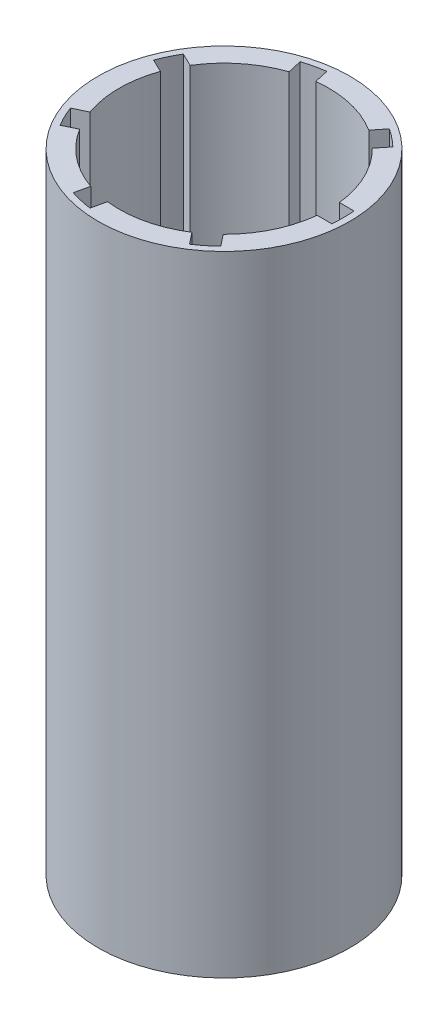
ISO-10303-21;
HEADER;
FILE_DESCRIPTION(('STEP AP214'),'2;1');
FILE_NAME('part.step','',(''),(''),'','','');
FILE_SCHEMA(('AUTOMOTIVE_DESIGN { 1 0 10303 214 1 1 1 1 }'));
ENDSEC;
DATA;
#1=APPLICATION_CONTEXT('core data for automotive mechanical design processes');
#2=APPLICATION_PROTOCOL_DEFINITION('international standard','automotive_design',2000,#1);
#3=PRODUCT_CONTEXT('',#1,'mechanical');
#4=PRODUCT('Part','Part','',(#3));
#5=PRODUCT_RELATED_PRODUCT_CATEGORY('part','',(#4));
#6=PRODUCT_DEFINITION_FORMATION('','',#4);
#7=PRODUCT_DEFINITION_CONTEXT('part definition',#1,'design');
#8=PRODUCT_DEFINITION('design','',#6,#7);
#9=PRODUCT_DEFINITION_SHAPE('','',#8);
#10=(LENGTH_UNIT() NAMED_UNIT(*) SI_UNIT(.MILLI.,.METRE.));
#11=(NAMED_UNIT(*) PLANE_ANGLE_UNIT() SI_UNIT($,.RADIAN.));
#12=(NAMED_UNIT(*) SI_UNIT($,.STERADIAN.) SOLID_ANGLE_UNIT());
#13=UNCERTAINTY_MEASURE_WITH_UNIT(LENGTH_MEASURE(1.E-05),#10,'distance_accuracy_value','');
#14=(GEOMETRIC_REPRESENTATION_CONTEXT(3) GLOBAL_UNCERTAINTY_ASSIGNED_CONTEXT((#13)) GLOBAL_UNIT_ASSIGNED_CONTEXT((#10,
#11,#12)) REPRESENTATION_CONTEXT('',''));
#15=CARTESIAN_POINT('',(0.,0.,0.));
#16=DIRECTION('',(0.,0.,1.));
#17=DIRECTION('',(1.,0.,0.));
#18=AXIS2_PLACEMENT_3D('',#15,#16,#17);
#19=CARTESIAN_POINT('',(0.,195.,0.));
#20=DIRECTION('',(0.,1.,0.));
#21=DIRECTION('',(0.,0.,1.));
#22=AXIS2_PLACEMENT_3D('',#19,#20,#21);
#23=PLANE('',#22);
#24=CARTESIAN_POINT('',(0.,195.,0.));
#25=DIRECTION('',(0.,1.,0.));
#26=DIRECTION('',(0.,0.,1.));
#27=AXIS2_PLACEMENT_3D('',#24,#25,#26);
#28=CIRCLE('',#27,39.);
#29=CARTESIAN_POINT('',(0.,195.,39.));
#30=VERTEX_POINT('',#29);
#31=EDGE_CURVE('E11',#30,#30,#28,.T.);
#32=ORIENTED_EDGE('',*,*,#31,.T.);
#33=EDGE_LOOP('',(#32));
#34=FACE_BOUND('',#33,.T.);
#35=DIRECTION('',(-0.900968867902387,0.,-0.433883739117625));
#36=VECTOR('',#35,1.);
#37=CARTESIAN_POINT('',(-31.7056204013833,195.,-19.0984451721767));
#38=LINE('',#37,#36);
#39=CARTESIAN_POINT('',(-27.6188483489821,195.,-17.130359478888));
#40=VERTEX_POINT('',#39);
#41=CARTESIAN_POINT('',(-31.7056204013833,195.,-19.0984451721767));
#42=VERTEX_POINT('',#41);
#43=EDGE_CURVE('E223',#40,#42,#38,.T.);
#44=ORIENTED_EDGE('',*,*,#43,.F.);
#45=CARTESIAN_POINT('',(0.,195.,0.));
#46=DIRECTION('',(0.,1.,0.));
#47=DIRECTION('',(0.,0.,1.));
#48=AXIS2_PLACEMENT_3D('',#45,#46,#47);
#49=CIRCLE('',#48,32.5);
#50=CARTESIAN_POINT('',(-10.5550936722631,195.,-30.7382497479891));
#51=VERTEX_POINT('',#50);
#52=EDGE_CURVE('E215',#51,#40,#49,.T.);
#53=ORIENTED_EDGE('',*,*,#52,.F.);
#54=DIRECTION('',(0.222520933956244,0.,0.97492791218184));
#55=VECTOR('',#54,1.);
#56=CARTESIAN_POINT('',(-11.5644430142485,195.,-35.1604981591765));
#57=LINE('',#56,#55);
#58=CARTESIAN_POINT('',(-11.5644430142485,195.,-35.1604981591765));
#59=VERTEX_POINT('',#58);
#60=EDGE_CURVE('E287',#59,#51,#57,.T.);
#61=ORIENTED_EDGE('',*,*,#60,.F.);
#62=CARTESIAN_POINT('',(0.,195.,0.));
#63=DIRECTION('',(0.,1.,0.));
#64=DIRECTION('',(0.,0.,-1.));
#65=AXIS2_PLACEMENT_3D('',#62,#63,#64);
#66=CIRCLE('',#65,37.0134701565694);
#67=CARTESIAN_POINT('',(-4.8363652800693,195.,-36.6961379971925));
#68=VERTEX_POINT('',#67);
#69=EDGE_CURVE('E285',#68,#59,#66,.T.);
#70=ORIENTED_EDGE('',*,*,#69,.F.);
#71=DIRECTION('',(-0.222520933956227,0.,-0.974927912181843));
#72=VECTOR('',#71,1.);
#73=CARTESIAN_POINT('',(-4.8363652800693,195.,-36.6961379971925));
#74=LINE('',#73,#72);
#75=CARTESIAN_POINT('',(-3.82701593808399,195.,-32.2738895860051));
#76=VERTEX_POINT('',#75);
#77=EDGE_CURVE('E283',#76,#68,#74,.T.);
#78=ORIENTED_EDGE('',*,*,#77,.F.);
#79=CARTESIAN_POINT('',(0.,195.,0.));
#80=DIRECTION('',(0.,1.,0.));
#81=DIRECTION('',(0.,0.,1.));
#82=AXIS2_PLACEMENT_3D('',#79,#80,#81);
#83=CIRCLE('',#82,32.5);
#84=CARTESIAN_POINT('',(17.4511381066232,195.,-27.4172897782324));
#85=VERTEX_POINT('',#84);
#86=EDGE_CURVE('E281',#85,#76,#83,.T.);
#87=ORIENTED_EDGE('',*,*,#86,.F.);
#88=DIRECTION('',(-0.623489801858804,0.,0.781831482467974));
#89=VECTOR('',#88,1.);
#90=CARTESIAN_POINT('',(20.2792721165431,195.,-30.9636576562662));
#91=LINE('',#90,#89);
#92=CARTESIAN_POINT('',(20.279272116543,195.,-30.9636576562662));
#93=VERTEX_POINT('',#92);
#94=EDGE_CURVE('E279',#93,#85,#91,.T.);
#95=ORIENTED_EDGE('',*,*,#94,.F.);
#96=CARTESIAN_POINT('',(0.,195.,0.));
#97=DIRECTION('',(0.,1.,0.));
#98=DIRECTION('',(0.,0.,-1.));
#99=AXIS2_PLACEMENT_3D('',#96,#97,#98);
#100=CIRCLE('',#99,37.0134701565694);
#101=CARTESIAN_POINT('',(25.6747715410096,195.,-26.6608904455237));
#102=VERTEX_POINT('',#101);
#103=EDGE_CURVE('E277',#102,#93,#100,.T.);
#104=ORIENTED_EDGE('',*,*,#103,.F.);
#105=DIRECTION('',(0.623489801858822,0.,-0.78183148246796));
#106=VECTOR('',#105,1.);
#107=CARTESIAN_POINT('',(25.6747715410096,195.,-26.6608904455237));
#108=LINE('',#107,#106);
#109=CARTESIAN_POINT('',(22.8466375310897,195.,-23.11452256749));
#110=VERTEX_POINT('',#109);
#111=EDGE_CURVE('E275',#110,#102,#108,.T.);
#112=ORIENTED_EDGE('',*,*,#111,.F.);
#113=CARTESIAN_POINT('',(0.,195.,0.));
#114=DIRECTION('',(0.,1.,0.));
#115=DIRECTION('',(0.,0.,1.));
#116=AXIS2_PLACEMENT_3D('',#113,#114,#115);
#117=CIRCLE('',#116,32.5);
#118=CARTESIAN_POINT('',(32.3163069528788,195.,-3.45055139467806));
#119=VERTEX_POINT('',#118);
#120=EDGE_CURVE('E273',#119,#110,#117,.T.);
#121=ORIENTED_EDGE('',*,*,#120,.F.);
#122=DIRECTION('',(-1.,0.,0.));
#123=VECTOR('',#122,1.);
#124=CARTESIAN_POINT('',(36.8522817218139,195.,-3.45055139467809));
#125=LINE('',#124,#123);
#126=CARTESIAN_POINT('',(36.8522817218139,195.,-3.45055139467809));
#127=VERTEX_POINT('',#126);
#128=EDGE_CURVE('E271',#127,#119,#125,.T.);
#129=ORIENTED_EDGE('',*,*,#128,.F.);
#130=CARTESIAN_POINT('',(0.,195.,0.));
#131=DIRECTION('',(0.,1.,0.));
#132=DIRECTION('',(0.,0.,-1.));
#133=AXIS2_PLACEMENT_3D('',#130,#131,#132);
#134=CIRCLE('',#133,37.0134701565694);
#135=CARTESIAN_POINT('',(36.8522817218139,195.,3.45055139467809));
#136=VERTEX_POINT('',#135);
#137=EDGE_CURVE('E269',#136,#127,#134,.T.);
#138=ORIENTED_EDGE('',*,*,#137,.F.);
#139=DIRECTION('',(1.,0.,0.));
#140=VECTOR('',#139,1.);
#141=CARTESIAN_POINT('',(36.8522817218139,195.,3.45055139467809));
#142=LINE('',#141,#140);
#143=CARTESIAN_POINT('',(32.3163069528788,195.,3.45055139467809));
#144=VERTEX_POINT('',#143);
#145=EDGE_CURVE('E267',#144,#136,#142,.T.);
#146=ORIENTED_EDGE('',*,*,#145,.F.);
#147=CARTESIAN_POINT('',(0.,195.,0.));
#148=DIRECTION('',(0.,1.,0.));
#149=DIRECTION('',(0.,0.,1.));
#150=AXIS2_PLACEMENT_3D('',#147,#148,#149);
#151=CIRCLE('',#150,32.5);
#152=CARTESIAN_POINT('',(22.8466375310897,195.,23.11452256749));
#153=VERTEX_POINT('',#152);
#154=EDGE_CURVE('E265',#153,#144,#151,.T.);
#155=ORIENTED_EDGE('',*,*,#154,.F.);
#156=DIRECTION('',(-0.623489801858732,0.,-0.781831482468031));
#157=VECTOR('',#156,1.);
#158=CARTESIAN_POINT('',(25.6747715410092,195.,26.6608904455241));
#159=LINE('',#158,#157);
#160=CARTESIAN_POINT('',(25.6747715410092,195.,26.6608904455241));
#161=VERTEX_POINT('',#160);
#162=EDGE_CURVE('E263',#161,#153,#159,.T.);
#163=ORIENTED_EDGE('',*,*,#162,.F.);
#164=CARTESIAN_POINT('',(0.,195.,0.));
#165=DIRECTION('',(0.,1.,0.));
#166=DIRECTION('',(0.,0.,-1.));
#167=AXIS2_PLACEMENT_3D('',#164,#165,#166);
#168=CIRCLE('',#167,37.0134701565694);
#169=CARTESIAN_POINT('',(20.2792721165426,195.,30.9636576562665));
#170=VERTEX_POINT('',#169);
#171=EDGE_CURVE('E261',#170,#161,#168,.T.);
#172=ORIENTED_EDGE('',*,*,#171,.F.);
#173=DIRECTION('',(0.623489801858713,0.,0.781831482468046));
#174=VECTOR('',#173,1.);
#175=CARTESIAN_POINT('',(20.2792721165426,195.,30.9636576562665));
#176=LINE('',#175,#174);
#177=CARTESIAN_POINT('',(17.4511381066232,195.,27.4172897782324));
#178=VERTEX_POINT('',#177);
#179=EDGE_CURVE('E259',#178,#170,#176,.T.);
#180=ORIENTED_EDGE('',*,*,#179,.F.);
#181=CARTESIAN_POINT('',(0.,195.,0.));
#182=DIRECTION('',(0.,1.,0.));
#183=DIRECTION('',(0.,0.,1.));
#184=AXIS2_PLACEMENT_3D('',#181,#182,#183);
#185=CIRCLE('',#184,32.5);
#186=CARTESIAN_POINT('',(-3.82701593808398,195.,32.2738895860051));
#187=VERTEX_POINT('',#186);
#188=EDGE_CURVE('E257',#187,#178,#185,.T.);
#189=ORIENTED_EDGE('',*,*,#188,.F.);
#190=DIRECTION('',(0.222520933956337,0.,-0.974927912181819));
#191=VECTOR('',#190,1.);
#192=CARTESIAN_POINT('',(-4.8363652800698,195.,36.6961379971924));
#193=LINE('',#192,#191);
#194=CARTESIAN_POINT('',(-4.83636528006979,195.,36.6961379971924));
#195=VERTEX_POINT('',#194);
#196=EDGE_CURVE('E255',#195,#187,#193,.T.);
#197=ORIENTED_EDGE('',*,*,#196,.F.);
#198=CARTESIAN_POINT('',(0.,195.,0.));
#199=DIRECTION('',(0.,1.,0.));
#200=DIRECTION('',(0.,0.,-1.));
#201=AXIS2_PLACEMENT_3D('',#198,#199,#200);
#202=CIRCLE('',#201,37.0134701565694);
#203=CARTESIAN_POINT('',(-11.564443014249,195.,35.1604981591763));
#204=VERTEX_POINT('',#203);
#205=EDGE_CURVE('E253',#204,#195,#202,.T.);
#206=ORIENTED_EDGE('',*,*,#205,.F.);
#207=DIRECTION('',(-0.222520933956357,0.,0.974927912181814));
#208=VECTOR('',#207,1.);
#209=CARTESIAN_POINT('',(-11.564443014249,195.,35.1604981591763));
#210=LINE('',#209,#208);
#211=CARTESIAN_POINT('',(-10.5550936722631,195.,30.7382497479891));
#212=VERTEX_POINT('',#211);
#213=EDGE_CURVE('E251',#212,#204,#210,.T.);
#214=ORIENTED_EDGE('',*,*,#213,.F.);
#215=CARTESIAN_POINT('',(0.,195.,0.));
#216=DIRECTION('',(0.,1.,0.));
#217=DIRECTION('',(0.,0.,1.));
#218=AXIS2_PLACEMENT_3D('',#215,#216,#217);
#219=CIRCLE('',#218,32.5);
#220=CARTESIAN_POINT('',(-27.6188483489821,195.,17.130359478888));
#221=VERTEX_POINT('',#220);
#222=EDGE_CURVE('E249',#221,#212,#219,.T.);
#223=ORIENTED_EDGE('',*,*,#222,.F.);
#224=DIRECTION('',(0.900968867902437,0.,-0.433883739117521));
#225=VECTOR('',#224,1.);
#226=CARTESIAN_POINT('',(-31.7056204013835,195.,19.0984451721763));
#227=LINE('',#226,#225);
#228=CARTESIAN_POINT('',(-31.7056204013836,195.,19.0984451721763));
#229=VERTEX_POINT('',#228);
#230=EDGE_CURVE('E247',#229,#221,#227,.T.);
#231=ORIENTED_EDGE('',*,*,#230,.F.);
#232=CARTESIAN_POINT('',(0.,195.,0.));
#233=DIRECTION('',(0.,1.,0.));
#234=DIRECTION('',(0.,0.,-1.));
#235=AXIS2_PLACEMENT_3D('',#232,#233,#234);
#236=CIRCLE('',#235,37.0134701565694);
#237=CARTESIAN_POINT('',(-34.6998966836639,195.,12.8807664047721));
#238=VERTEX_POINT('',#237);
#239=EDGE_CURVE('E245',#238,#229,#236,.T.);
#240=ORIENTED_EDGE('',*,*,#239,.F.);
#241=DIRECTION('',(-0.900968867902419,0.,0.433883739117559));
#242=VECTOR('',#241,1.);
#243=CARTESIAN_POINT('',(-34.6998966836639,195.,12.8807664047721));
#244=LINE('',#243,#242);
#245=CARTESIAN_POINT('',(-30.6131246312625,195.,10.9126807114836));
#246=VERTEX_POINT('',#245);
#247=EDGE_CURVE('E243',#246,#238,#244,.T.);
#248=ORIENTED_EDGE('',*,*,#247,.F.);
#249=CARTESIAN_POINT('',(0.,195.,0.));
#250=DIRECTION('',(0.,1.,0.));
#251=DIRECTION('',(0.,0.,1.));
#252=AXIS2_PLACEMENT_3D('',#249,#250,#251);
#253=CIRCLE('',#252,32.5);
#254=CARTESIAN_POINT('',(-30.6131246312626,195.,-10.9126807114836));
#255=VERTEX_POINT('',#254);
#256=EDGE_CURVE('E241',#255,#246,#253,.T.);
#257=ORIENTED_EDGE('',*,*,#256,.F.);
#258=DIRECTION('',(0.900968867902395,0.,0.433883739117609));
#259=VECTOR('',#258,1.);
#260=CARTESIAN_POINT('',(-34.6998966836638,195.,-12.8807664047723));
#261=LINE('',#260,#259);
#262=CARTESIAN_POINT('',(-34.6998966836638,195.,-12.8807664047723));
#263=VERTEX_POINT('',#262);
#264=EDGE_CURVE('E237',#263,#255,#261,.T.);
#265=ORIENTED_EDGE('',*,*,#264,.F.);
#266=CARTESIAN_POINT('',(0.,195.,0.));
#267=DIRECTION('',(0.,1.,0.));
#268=DIRECTION('',(0.,0.,-1.));
#269=AXIS2_PLACEMENT_3D('',#266,#267,#268);
#270=CIRCLE('',#269,37.0134701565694);
#271=EDGE_CURVE('E235',#42,#263,#270,.T.);
#272=ORIENTED_EDGE('',*,*,#271,.F.);
#273=EDGE_LOOP('',(#44,#53,#61,#70,#78,#87,#95,#104,#112,#121,#129,#138,#146,#155,#163,#172,
#180,#189,#197,#206,#214,#223,#231,#240,#248,#257,#265,#272));
#274=FACE_BOUND('',#273,.T.);
#275=ADVANCED_FACE('F30',(#34,#274),#23,.T.);
#276=CARTESIAN_POINT('',(0.,0.,0.));
#277=DIRECTION('',(0.,1.,0.));
#278=DIRECTION('',(0.,0.,1.));
#279=AXIS2_PLACEMENT_3D('',#276,#277,#278);
#280=PLANE('',#279);
#281=CARTESIAN_POINT('',(0.,0.,0.));
#282=DIRECTION('',(0.,1.,0.));
#283=DIRECTION('',(0.,0.,1.));
#284=AXIS2_PLACEMENT_3D('',#281,#282,#283);
#285=CIRCLE('',#284,39.);
#286=CARTESIAN_POINT('',(0.,0.,39.));
#287=VERTEX_POINT('',#286);
#288=EDGE_CURVE('E34',#287,#287,#285,.T.);
#289=ORIENTED_EDGE('',*,*,#288,.F.);
#290=EDGE_LOOP('',(#289));
#291=FACE_BOUND('',#290,.T.);
#292=CARTESIAN_POINT('',(0.,0.,0.));
#293=DIRECTION('',(0.,1.,0.));
#294=DIRECTION('',(0.,0.,1.));
#295=AXIS2_PLACEMENT_3D('',#292,#293,#294);
#296=CIRCLE('',#295,32.5);
#297=CARTESIAN_POINT('',(-10.5550936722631,0.,-30.7382497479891));
#298=VERTEX_POINT('',#297);
#299=CARTESIAN_POINT('',(-27.6188483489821,0.,-17.130359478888));
#300=VERTEX_POINT('',#299);
#301=EDGE_CURVE('E53',#298,#300,#296,.T.);
#302=ORIENTED_EDGE('',*,*,#301,.T.);
#303=DIRECTION('',(-0.900968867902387,0.,-0.433883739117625));
#304=VECTOR('',#303,1.);
#305=CARTESIAN_POINT('',(-31.7056204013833,0.,-19.0984451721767));
#306=LINE('',#305,#304);
#307=CARTESIAN_POINT('',(-31.7056204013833,0.,-19.0984451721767));
#308=VERTEX_POINT('',#307);
#309=EDGE_CURVE('E230',#300,#308,#306,.T.);
#310=ORIENTED_EDGE('',*,*,#309,.T.);
#311=CARTESIAN_POINT('',(0.,0.,0.));
#312=DIRECTION('',(0.,1.,0.));
#313=DIRECTION('',(0.,0.,-1.));
#314=AXIS2_PLACEMENT_3D('',#311,#312,#313);
#315=CIRCLE('',#314,37.0134701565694);
#316=CARTESIAN_POINT('',(-34.6998966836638,0.,-12.8807664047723));
#317=VERTEX_POINT('',#316);
#318=EDGE_CURVE('E291',#308,#317,#315,.T.);
#319=ORIENTED_EDGE('',*,*,#318,.T.);
#320=DIRECTION('',(0.900968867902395,0.,0.433883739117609));
#321=VECTOR('',#320,1.);
#322=CARTESIAN_POINT('',(-34.6998966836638,0.,-12.8807664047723));
#323=LINE('',#322,#321);
#324=CARTESIAN_POINT('',(-30.6131246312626,0.,-10.9126807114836));
#325=VERTEX_POINT('',#324);
#326=EDGE_CURVE('E294',#317,#325,#323,.T.);
#327=ORIENTED_EDGE('',*,*,#326,.T.);
#328=CARTESIAN_POINT('',(0.,0.,0.));
#329=DIRECTION('',(0.,1.,0.));
#330=DIRECTION('',(0.,0.,1.));
#331=AXIS2_PLACEMENT_3D('',#328,#329,#330);
#332=CIRCLE('',#331,32.5);
#333=CARTESIAN_POINT('',(-30.6131246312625,0.,10.9126807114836));
#334=VERTEX_POINT('',#333);
#335=EDGE_CURVE('E297',#325,#334,#332,.T.);
#336=ORIENTED_EDGE('',*,*,#335,.T.);
#337=DIRECTION('',(-0.900968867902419,0.,0.433883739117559));
#338=VECTOR('',#337,1.);
#339=CARTESIAN_POINT('',(-34.6998966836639,0.,12.8807664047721));
#340=LINE('',#339,#338);
#341=CARTESIAN_POINT('',(-34.6998966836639,0.,12.8807664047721));
#342=VERTEX_POINT('',#341);
#343=EDGE_CURVE('E300',#334,#342,#340,.T.);
#344=ORIENTED_EDGE('',*,*,#343,.T.);
#345=CARTESIAN_POINT('',(0.,0.,0.));
#346=DIRECTION('',(0.,1.,0.));
#347=DIRECTION('',(0.,0.,-1.));
#348=AXIS2_PLACEMENT_3D('',#345,#346,#347);
#349=CIRCLE('',#348,37.0134701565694);
#350=CARTESIAN_POINT('',(-31.7056204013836,0.,19.0984451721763));
#351=VERTEX_POINT('',#350);
#352=EDGE_CURVE('E303',#342,#351,#349,.T.);
#353=ORIENTED_EDGE('',*,*,#352,.T.);
#354=DIRECTION('',(0.900968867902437,0.,-0.433883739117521));
#355=VECTOR('',#354,1.);
#356=CARTESIAN_POINT('',(-31.7056204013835,0.,19.0984451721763));
#357=LINE('',#356,#355);
#358=CARTESIAN_POINT('',(-27.6188483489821,0.,17.130359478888));
#359=VERTEX_POINT('',#358);
#360=EDGE_CURVE('E306',#351,#359,#357,.T.);
#361=ORIENTED_EDGE('',*,*,#360,.T.);
#362=CARTESIAN_POINT('',(0.,0.,0.));
#363=DIRECTION('',(0.,1.,0.));
#364=DIRECTION('',(0.,0.,1.));
#365=AXIS2_PLACEMENT_3D('',#362,#363,#364);
#366=CIRCLE('',#365,32.5);
#367=CARTESIAN_POINT('',(-10.5550936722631,0.,30.7382497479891));
#368=VERTEX_POINT('',#367);
#369=EDGE_CURVE('E309',#359,#368,#366,.T.);
#370=ORIENTED_EDGE('',*,*,#369,.T.);
#371=DIRECTION('',(-0.222520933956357,0.,0.974927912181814));
#372=VECTOR('',#371,1.);
#373=CARTESIAN_POINT('',(-11.564443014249,0.,35.1604981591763));
#374=LINE('',#373,#372);
#375=CARTESIAN_POINT('',(-11.564443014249,0.,35.1604981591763));
#376=VERTEX_POINT('',#375);
#377=EDGE_CURVE('E312',#368,#376,#374,.T.);
#378=ORIENTED_EDGE('',*,*,#377,.T.);
#379=CARTESIAN_POINT('',(0.,0.,0.));
#380=DIRECTION('',(0.,1.,0.));
#381=DIRECTION('',(0.,0.,-1.));
#382=AXIS2_PLACEMENT_3D('',#379,#380,#381);
#383=CIRCLE('',#382,37.0134701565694);
#384=CARTESIAN_POINT('',(-4.83636528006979,0.,36.6961379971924));
#385=VERTEX_POINT('',#384);
#386=EDGE_CURVE('E315',#376,#385,#383,.T.);
#387=ORIENTED_EDGE('',*,*,#386,.T.);
#388=DIRECTION('',(0.222520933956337,0.,-0.974927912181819));
#389=VECTOR('',#388,1.);
#390=CARTESIAN_POINT('',(-4.8363652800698,0.,36.6961379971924));
#391=LINE('',#390,#389);
#392=CARTESIAN_POINT('',(-3.82701593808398,0.,32.2738895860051));
#393=VERTEX_POINT('',#392);
#394=EDGE_CURVE('E318',#385,#393,#391,.T.);
#395=ORIENTED_EDGE('',*,*,#394,.T.);
#396=CARTESIAN_POINT('',(0.,0.,0.));
#397=DIRECTION('',(0.,1.,0.));
#398=DIRECTION('',(0.,0.,1.));
#399=AXIS2_PLACEMENT_3D('',#396,#397,#398);
#400=CIRCLE('',#399,32.5);
#401=CARTESIAN_POINT('',(17.4511381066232,0.,27.4172897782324));
#402=VERTEX_POINT('',#401);
#403=EDGE_CURVE('E321',#393,#402,#400,.T.);
#404=ORIENTED_EDGE('',*,*,#403,.T.);
#405=DIRECTION('',(0.623489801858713,0.,0.781831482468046));
#406=VECTOR('',#405,1.);
#407=CARTESIAN_POINT('',(20.2792721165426,0.,30.9636576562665));
#408=LINE('',#407,#406);
#409=CARTESIAN_POINT('',(20.2792721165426,0.,30.9636576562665));
#410=VERTEX_POINT('',#409);
#411=EDGE_CURVE('E324',#402,#410,#408,.T.);
#412=ORIENTED_EDGE('',*,*,#411,.T.);
#413=CARTESIAN_POINT('',(0.,0.,0.));
#414=DIRECTION('',(0.,1.,0.));
#415=DIRECTION('',(0.,0.,-1.));
#416=AXIS2_PLACEMENT_3D('',#413,#414,#415);
#417=CIRCLE('',#416,37.0134701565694);
#418=CARTESIAN_POINT('',(25.6747715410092,0.,26.6608904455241));
#419=VERTEX_POINT('',#418);
#420=EDGE_CURVE('E327',#410,#419,#417,.T.);
#421=ORIENTED_EDGE('',*,*,#420,.T.);
#422=DIRECTION('',(-0.623489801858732,0.,-0.781831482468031));
#423=VECTOR('',#422,1.);
#424=CARTESIAN_POINT('',(25.6747715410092,0.,26.6608904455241));
#425=LINE('',#424,#423);
#426=CARTESIAN_POINT('',(22.8466375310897,0.,23.11452256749));
#427=VERTEX_POINT('',#426);
#428=EDGE_CURVE('E330',#419,#427,#425,.T.);
#429=ORIENTED_EDGE('',*,*,#428,.T.);
#430=CARTESIAN_POINT('',(0.,0.,0.));
#431=DIRECTION('',(0.,1.,0.));
#432=DIRECTION('',(0.,0.,1.));
#433=AXIS2_PLACEMENT_3D('',#430,#431,#432);
#434=CIRCLE('',#433,32.5);
#435=CARTESIAN_POINT('',(32.3163069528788,0.,3.45055139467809));
#436=VERTEX_POINT('',#435);
#437=EDGE_CURVE('E333',#427,#436,#434,.T.);
#438=ORIENTED_EDGE('',*,*,#437,.T.);
#439=DIRECTION('',(1.,0.,0.));
#440=VECTOR('',#439,1.);
#441=CARTESIAN_POINT('',(36.8522817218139,0.,3.45055139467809));
#442=LINE('',#441,#440);
#443=CARTESIAN_POINT('',(36.8522817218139,0.,3.45055139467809));
#444=VERTEX_POINT('',#443);
#445=EDGE_CURVE('E336',#436,#444,#442,.T.);
#446=ORIENTED_EDGE('',*,*,#445,.T.);
#447=CARTESIAN_POINT('',(0.,0.,0.));
#448=DIRECTION('',(0.,1.,0.));
#449=DIRECTION('',(0.,0.,-1.));
#450=AXIS2_PLACEMENT_3D('',#447,#448,#449);
#451=CIRCLE('',#450,37.0134701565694);
#452=CARTESIAN_POINT('',(36.8522817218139,0.,-3.45055139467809));
#453=VERTEX_POINT('',#452);
#454=EDGE_CURVE('E339',#444,#453,#451,.T.);
#455=ORIENTED_EDGE('',*,*,#454,.T.);
#456=DIRECTION('',(-1.,0.,0.));
#457=VECTOR('',#456,1.);
#458=CARTESIAN_POINT('',(36.8522817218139,0.,-3.45055139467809));
#459=LINE('',#458,#457);
#460=CARTESIAN_POINT('',(32.3163069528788,0.,-3.45055139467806));
#461=VERTEX_POINT('',#460);
#462=EDGE_CURVE('E342',#453,#461,#459,.T.);
#463=ORIENTED_EDGE('',*,*,#462,.T.);
#464=CARTESIAN_POINT('',(0.,0.,0.));
#465=DIRECTION('',(0.,1.,0.));
#466=DIRECTION('',(0.,0.,1.));
#467=AXIS2_PLACEMENT_3D('',#464,#465,#466);
#468=CIRCLE('',#467,32.5);
#469=CARTESIAN_POINT('',(22.8466375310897,0.,-23.11452256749));
#470=VERTEX_POINT('',#469);
#471=EDGE_CURVE('E345',#461,#470,#468,.T.);
#472=ORIENTED_EDGE('',*,*,#471,.T.);
#473=DIRECTION('',(0.623489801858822,0.,-0.78183148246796));
#474=VECTOR('',#473,1.);
#475=CARTESIAN_POINT('',(25.6747715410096,0.,-26.6608904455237));
#476=LINE('',#475,#474);
#477=CARTESIAN_POINT('',(25.6747715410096,0.,-26.6608904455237));
#478=VERTEX_POINT('',#477);
#479=EDGE_CURVE('E348',#470,#478,#476,.T.);
#480=ORIENTED_EDGE('',*,*,#479,.T.);
#481=CARTESIAN_POINT('',(0.,0.,0.));
#482=DIRECTION('',(0.,1.,0.));
#483=DIRECTION('',(0.,0.,-1.));
#484=AXIS2_PLACEMENT_3D('',#481,#482,#483);
#485=CIRCLE('',#484,37.0134701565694);
#486=CARTESIAN_POINT('',(20.279272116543,0.,-30.9636576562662));
#487=VERTEX_POINT('',#486);
#488=EDGE_CURVE('E351',#478,#487,#485,.T.);
#489=ORIENTED_EDGE('',*,*,#488,.T.);
#490=DIRECTION('',(-0.623489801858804,0.,0.781831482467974));
#491=VECTOR('',#490,1.);
#492=CARTESIAN_POINT('',(20.2792721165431,0.,-30.9636576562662));
#493=LINE('',#492,#491);
#494=CARTESIAN_POINT('',(17.4511381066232,0.,-27.4172897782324));
#495=VERTEX_POINT('',#494);
#496=EDGE_CURVE('E354',#487,#495,#493,.T.);
#497=ORIENTED_EDGE('',*,*,#496,.T.);
#498=CARTESIAN_POINT('',(0.,0.,0.));
#499=DIRECTION('',(0.,1.,0.));
#500=DIRECTION('',(0.,0.,1.));
#501=AXIS2_PLACEMENT_3D('',#498,#499,#500);
#502=CIRCLE('',#501,32.5);
#503=CARTESIAN_POINT('',(-3.82701593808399,0.,-32.2738895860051));
#504=VERTEX_POINT('',#503);
#505=EDGE_CURVE('E357',#495,#504,#502,.T.);
#506=ORIENTED_EDGE('',*,*,#505,.T.);
#507=DIRECTION('',(-0.222520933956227,0.,-0.974927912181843));
#508=VECTOR('',#507,1.);
#509=CARTESIAN_POINT('',(-4.8363652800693,0.,-36.6961379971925));
#510=LINE('',#509,#508);
#511=CARTESIAN_POINT('',(-4.8363652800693,0.,-36.6961379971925));
#512=VERTEX_POINT('',#511);
#513=EDGE_CURVE('E360',#504,#512,#510,.T.);
#514=ORIENTED_EDGE('',*,*,#513,.T.);
#515=CARTESIAN_POINT('',(0.,0.,0.));
#516=DIRECTION('',(0.,1.,0.));
#517=DIRECTION('',(0.,0.,-1.));
#518=AXIS2_PLACEMENT_3D('',#515,#516,#517);
#519=CIRCLE('',#518,37.0134701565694);
#520=CARTESIAN_POINT('',(-11.5644430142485,0.,-35.1604981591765));
#521=VERTEX_POINT('',#520);
#522=EDGE_CURVE('E363',#512,#521,#519,.T.);
#523=ORIENTED_EDGE('',*,*,#522,.T.);
#524=DIRECTION('',(0.222520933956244,0.,0.97492791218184));
#525=VECTOR('',#524,1.);
#526=CARTESIAN_POINT('',(-11.5644430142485,0.,-35.1604981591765));
#527=LINE('',#526,#525);
#528=EDGE_CURVE('E224',#521,#298,#527,.T.);
#529=ORIENTED_EDGE('',*,*,#528,.T.);
#530=EDGE_LOOP('',(#302,#310,#319,#327,#336,#344,#353,#361,#370,#378,#387,#395,#404,#412,#421,
#429,#438,#446,#455,#463,#472,#480,#489,#497,#506,#514,#523,#529));
#531=FACE_BOUND('',#530,.T.);
#532=ADVANCED_FACE('F424',(#291,#531),#280,.F.);
#533=CARTESIAN_POINT('',(0.,195.,0.));
#534=DIRECTION('',(0.,-1.,0.));
#535=DIRECTION('',(0.,0.,-1.));
#536=AXIS2_PLACEMENT_3D('',#533,#534,#535);
#537=CYLINDRICAL_SURFACE('',#536,39.);
#538=ORIENTED_EDGE('',*,*,#31,.F.);
#539=EDGE_LOOP('',(#538));
#540=FACE_BOUND('',#539,.T.);
#541=ORIENTED_EDGE('',*,*,#288,.T.);
#542=EDGE_LOOP('',(#541));
#543=FACE_BOUND('',#542,.T.);
#544=ADVANCED_FACE('F32',(#540,#543),#537,.T.);
#545=CARTESIAN_POINT('',(0.,195.,0.));
#546=DIRECTION('',(0.,-1.,0.));
#547=DIRECTION('',(0.,0.,-1.));
#548=AXIS2_PLACEMENT_3D('',#545,#546,#547);
#549=CYLINDRICAL_SURFACE('',#548,32.5);
#550=ORIENTED_EDGE('',*,*,#301,.F.);
#551=DIRECTION('',(0.,-1.,0.));
#552=VECTOR('',#551,1.);
#553=CARTESIAN_POINT('',(-10.5550936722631,195.,-30.7382497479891));
#554=LINE('',#553,#552);
#555=EDGE_CURVE('E219',#51,#298,#554,.T.);
#556=ORIENTED_EDGE('',*,*,#555,.F.);
#557=ORIENTED_EDGE('',*,*,#52,.T.);
#558=DIRECTION('',(0.,-1.,0.));
#559=VECTOR('',#558,1.);
#560=CARTESIAN_POINT('',(-27.6188483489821,195.,-17.130359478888));
#561=LINE('',#560,#559);
#562=EDGE_CURVE('E218',#40,#300,#561,.T.);
#563=ORIENTED_EDGE('',*,*,#562,.T.);
#564=EDGE_LOOP('',(#550,#556,#557,#563));
#565=FACE_BOUND('',#564,.T.);
#566=ADVANCED_FACE('F217',(#565),#549,.F.);
#567=CARTESIAN_POINT('',(-31.7056204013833,195.,-19.0984451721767));
#568=DIRECTION('',(-0.433883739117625,0.,0.900968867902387));
#569=DIRECTION('',(0.900968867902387,0.,0.433883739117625));
#570=AXIS2_PLACEMENT_3D('',#567,#568,#569);
#571=PLANE('',#570);
#572=ORIENTED_EDGE('',*,*,#309,.F.);
#573=ORIENTED_EDGE('',*,*,#562,.F.);
#574=ORIENTED_EDGE('',*,*,#43,.T.);
#575=DIRECTION('',(0.,-1.,0.));
#576=VECTOR('',#575,1.);
#577=CARTESIAN_POINT('',(-31.7056204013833,195.,-19.0984451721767));
#578=LINE('',#577,#576);
#579=EDGE_CURVE('E231',#42,#308,#578,.T.);
#580=ORIENTED_EDGE('',*,*,#579,.T.);
#581=EDGE_LOOP('',(#572,#573,#574,#580));
#582=FACE_BOUND('',#581,.T.);
#583=ADVANCED_FACE('F227',(#582),#571,.T.);
#584=CARTESIAN_POINT('',(0.,195.,0.));
#585=DIRECTION('',(0.,-1.,0.));
#586=DIRECTION('',(0.,0.,-1.));
#587=AXIS2_PLACEMENT_3D('',#584,#585,#586);
#588=CYLINDRICAL_SURFACE('',#587,37.0134701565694);
#589=ORIENTED_EDGE('',*,*,#318,.F.);
#590=ORIENTED_EDGE('',*,*,#579,.F.);
#591=ORIENTED_EDGE('',*,*,#271,.T.);
#592=DIRECTION('',(0.,-1.,0.));
#593=VECTOR('',#592,1.);
#594=CARTESIAN_POINT('',(-34.6998966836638,195.,-12.8807664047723));
#595=LINE('',#594,#593);
#596=EDGE_CURVE('E416',#263,#317,#595,.T.);
#597=ORIENTED_EDGE('',*,*,#596,.T.);
#598=EDGE_LOOP('',(#589,#590,#591,#597));
#599=FACE_BOUND('',#598,.T.);
#600=ADVANCED_FACE('F420',(#599),#588,.F.);
#601=CARTESIAN_POINT('',(-34.6998966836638,195.,-12.8807664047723));
#602=DIRECTION('',(0.433883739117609,0.,-0.900968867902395));
#603=DIRECTION('',(-0.900968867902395,0.,-0.433883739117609));
#604=AXIS2_PLACEMENT_3D('',#601,#602,#603);
#605=PLANE('',#604);
#606=ORIENTED_EDGE('',*,*,#326,.F.);
#607=ORIENTED_EDGE('',*,*,#596,.F.);
#608=ORIENTED_EDGE('',*,*,#264,.T.);
#609=DIRECTION('',(0.,-1.,0.));
#610=VECTOR('',#609,1.);
#611=CARTESIAN_POINT('',(-30.6131246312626,195.,-10.9126807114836));
#612=LINE('',#611,#610);
#613=EDGE_CURVE('E414',#255,#325,#612,.T.);
#614=ORIENTED_EDGE('',*,*,#613,.T.);
#615=EDGE_LOOP('',(#606,#607,#608,#614));
#616=FACE_BOUND('',#615,.T.);
#617=ADVANCED_FACE('F542',(#616),#605,.T.);
#618=CARTESIAN_POINT('',(0.,195.,0.));
#619=DIRECTION('',(0.,-1.,0.));
#620=DIRECTION('',(0.,0.,-1.));
#621=AXIS2_PLACEMENT_3D('',#618,#619,#620);
#622=CYLINDRICAL_SURFACE('',#621,32.5);
#623=ORIENTED_EDGE('',*,*,#335,.F.);
#624=ORIENTED_EDGE('',*,*,#613,.F.);
#625=ORIENTED_EDGE('',*,*,#256,.T.);
#626=DIRECTION('',(0.,-1.,0.));
#627=VECTOR('',#626,1.);
#628=CARTESIAN_POINT('',(-30.6131246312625,195.,10.9126807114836));
#629=LINE('',#628,#627);
#630=EDGE_CURVE('E412',#246,#334,#629,.T.);
#631=ORIENTED_EDGE('',*,*,#630,.T.);
#632=EDGE_LOOP('',(#623,#624,#625,#631));
#633=FACE_BOUND('',#632,.T.);
#634=ADVANCED_FACE('F539',(#633),#622,.F.);
#635=CARTESIAN_POINT('',(-34.6998966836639,195.,12.8807664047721));
#636=DIRECTION('',(0.433883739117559,0.,0.900968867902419));
#637=DIRECTION('',(0.900968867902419,0.,-0.433883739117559));
#638=AXIS2_PLACEMENT_3D('',#635,#636,#637);
#639=PLANE('',#638);
#640=ORIENTED_EDGE('',*,*,#343,.F.);
#641=ORIENTED_EDGE('',*,*,#630,.F.);
#642=ORIENTED_EDGE('',*,*,#247,.T.);
#643=DIRECTION('',(0.,-1.,0.));
#644=VECTOR('',#643,1.);
#645=CARTESIAN_POINT('',(-34.6998966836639,195.,12.8807664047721));
#646=LINE('',#645,#644);
#647=EDGE_CURVE('E410',#238,#342,#646,.T.);
#648=ORIENTED_EDGE('',*,*,#647,.T.);
#649=EDGE_LOOP('',(#640,#641,#642,#648));
#650=FACE_BOUND('',#649,.T.);
#651=ADVANCED_FACE('F536',(#650),#639,.T.);
#652=CARTESIAN_POINT('',(0.,195.,0.));
#653=DIRECTION('',(0.,-1.,0.));
#654=DIRECTION('',(0.,0.,-1.));
#655=AXIS2_PLACEMENT_3D('',#652,#653,#654);
#656=CYLINDRICAL_SURFACE('',#655,37.0134701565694);
#657=ORIENTED_EDGE('',*,*,#352,.F.);
#658=ORIENTED_EDGE('',*,*,#647,.F.);
#659=ORIENTED_EDGE('',*,*,#239,.T.);
#660=DIRECTION('',(0.,-1.,0.));
#661=VECTOR('',#660,1.);
#662=CARTESIAN_POINT('',(-31.7056204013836,195.,19.0984451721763));
#663=LINE('',#662,#661);
#664=EDGE_CURVE('E408',#229,#351,#663,.T.);
#665=ORIENTED_EDGE('',*,*,#664,.T.);
#666=EDGE_LOOP('',(#657,#658,#659,#665));
#667=FACE_BOUND('',#666,.T.);
#668=ADVANCED_FACE('F529',(#667),#656,.F.);
#669=CARTESIAN_POINT('',(-31.7056204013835,195.,19.0984451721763));
#670=DIRECTION('',(-0.433883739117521,0.,-0.900968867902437));
#671=DIRECTION('',(-0.900968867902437,0.,0.433883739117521));
#672=AXIS2_PLACEMENT_3D('',#669,#670,#671);
#673=PLANE('',#672);
#674=ORIENTED_EDGE('',*,*,#360,.F.);
#675=ORIENTED_EDGE('',*,*,#664,.F.);
#676=ORIENTED_EDGE('',*,*,#230,.T.);
#677=DIRECTION('',(0.,-1.,0.));
#678=VECTOR('',#677,1.);
#679=CARTESIAN_POINT('',(-27.6188483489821,195.,17.130359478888));
#680=LINE('',#679,#678);
#681=EDGE_CURVE('E406',#221,#359,#680,.T.);
#682=ORIENTED_EDGE('',*,*,#681,.T.);
#683=EDGE_LOOP('',(#674,#675,#676,#682));
#684=FACE_BOUND('',#683,.T.);
#685=ADVANCED_FACE('F525',(#684),#673,.T.);
#686=CARTESIAN_POINT('',(0.,195.,0.));
#687=DIRECTION('',(0.,-1.,0.));
#688=DIRECTION('',(0.,0.,-1.));
#689=AXIS2_PLACEMENT_3D('',#686,#687,#688);
#690=CYLINDRICAL_SURFACE('',#689,32.5);
#691=ORIENTED_EDGE('',*,*,#369,.F.);
#692=ORIENTED_EDGE('',*,*,#681,.F.);
#693=ORIENTED_EDGE('',*,*,#222,.T.);
#694=DIRECTION('',(0.,-1.,0.));
#695=VECTOR('',#694,1.);
#696=CARTESIAN_POINT('',(-10.5550936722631,195.,30.7382497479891));
#697=LINE('',#696,#695);
#698=EDGE_CURVE('E404',#212,#368,#697,.T.);
#699=ORIENTED_EDGE('',*,*,#698,.T.);
#700=EDGE_LOOP('',(#691,#692,#693,#699));
#701=FACE_BOUND('',#700,.T.);
#702=ADVANCED_FACE('F522',(#701),#690,.F.);
#703=CARTESIAN_POINT('',(-11.564443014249,195.,35.1604981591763));
#704=DIRECTION('',(0.974927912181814,0.,0.222520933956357));
#705=DIRECTION('',(0.222520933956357,0.,-0.974927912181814));
#706=AXIS2_PLACEMENT_3D('',#703,#704,#705);
#707=PLANE('',#706);
#708=ORIENTED_EDGE('',*,*,#377,.F.);
#709=ORIENTED_EDGE('',*,*,#698,.F.);
#710=ORIENTED_EDGE('',*,*,#213,.T.);
#711=DIRECTION('',(0.,-1.,0.));
#712=VECTOR('',#711,1.);
#713=CARTESIAN_POINT('',(-11.564443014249,195.,35.1604981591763));
#714=LINE('',#713,#712);
#715=EDGE_CURVE('E402',#204,#376,#714,.T.);
#716=ORIENTED_EDGE('',*,*,#715,.T.);
#717=EDGE_LOOP('',(#708,#709,#710,#716));
#718=FACE_BOUND('',#717,.T.);
#719=ADVANCED_FACE('F514',(#718),#707,.T.);
#720=CARTESIAN_POINT('',(0.,195.,0.));
#721=DIRECTION('',(0.,-1.,0.));
#722=DIRECTION('',(0.,0.,-1.));
#723=AXIS2_PLACEMENT_3D('',#720,#721,#722);
#724=CYLINDRICAL_SURFACE('',#723,37.0134701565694);
#725=ORIENTED_EDGE('',*,*,#386,.F.);
#726=ORIENTED_EDGE('',*,*,#715,.F.);
#727=ORIENTED_EDGE('',*,*,#205,.T.);
#728=DIRECTION('',(0.,-1.,0.));
#729=VECTOR('',#728,1.);
#730=CARTESIAN_POINT('',(-4.83636528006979,195.,36.6961379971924));
#731=LINE('',#730,#729);
#732=EDGE_CURVE('E400',#195,#385,#731,.T.);
#733=ORIENTED_EDGE('',*,*,#732,.T.);
#734=EDGE_LOOP('',(#725,#726,#727,#733));
#735=FACE_BOUND('',#734,.T.);
#736=ADVANCED_FACE('F510',(#735),#724,.F.);
#737=CARTESIAN_POINT('',(-4.8363652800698,195.,36.6961379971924));
#738=DIRECTION('',(-0.974927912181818,0.,-0.222520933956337));
#739=DIRECTION('',(-0.222520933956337,0.,0.974927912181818));
#740=AXIS2_PLACEMENT_3D('',#737,#738,#739);
#741=PLANE('',#740);
#742=ORIENTED_EDGE('',*,*,#394,.F.);
#743=ORIENTED_EDGE('',*,*,#732,.F.);
#744=ORIENTED_EDGE('',*,*,#196,.T.);
#745=DIRECTION('',(0.,-1.,0.));
#746=VECTOR('',#745,1.);
#747=CARTESIAN_POINT('',(-3.82701593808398,195.,32.2738895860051));
#748=LINE('',#747,#746);
#749=EDGE_CURVE('E398',#187,#393,#748,.T.);
#750=ORIENTED_EDGE('',*,*,#749,.T.);
#751=EDGE_LOOP('',(#742,#743,#744,#750));
#752=FACE_BOUND('',#751,.T.);
#753=ADVANCED_FACE('F507',(#752),#741,.T.);
#754=CARTESIAN_POINT('',(0.,195.,0.));
#755=DIRECTION('',(0.,-1.,0.));
#756=DIRECTION('',(0.,0.,-1.));
#757=AXIS2_PLACEMENT_3D('',#754,#755,#756);
#758=CYLINDRICAL_SURFACE('',#757,32.5);
#759=ORIENTED_EDGE('',*,*,#403,.F.);
#760=ORIENTED_EDGE('',*,*,#749,.F.);
#761=ORIENTED_EDGE('',*,*,#188,.T.);
#762=DIRECTION('',(0.,-1.,0.));
#763=VECTOR('',#762,1.);
#764=CARTESIAN_POINT('',(17.4511381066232,195.,27.4172897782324));
#765=LINE('',#764,#763);
#766=EDGE_CURVE('E396',#178,#402,#765,.T.);
#767=ORIENTED_EDGE('',*,*,#766,.T.);
#768=EDGE_LOOP('',(#759,#760,#761,#767));
#769=FACE_BOUND('',#768,.T.);
#770=ADVANCED_FACE('F499',(#769),#758,.F.);
#771=CARTESIAN_POINT('',(20.2792721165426,195.,30.9636576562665));
#772=DIRECTION('',(0.781831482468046,0.,-0.623489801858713));
#773=DIRECTION('',(-0.623489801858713,0.,-0.781831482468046));
#774=AXIS2_PLACEMENT_3D('',#771,#772,#773);
#775=PLANE('',#774);
#776=ORIENTED_EDGE('',*,*,#411,.F.);
#777=ORIENTED_EDGE('',*,*,#766,.F.);
#778=ORIENTED_EDGE('',*,*,#179,.T.);
#779=DIRECTION('',(0.,-1.,0.));
#780=VECTOR('',#779,1.);
#781=CARTESIAN_POINT('',(20.2792721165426,195.,30.9636576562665));
#782=LINE('',#781,#780);
#783=EDGE_CURVE('E394',#170,#410,#782,.T.);
#784=ORIENTED_EDGE('',*,*,#783,.T.);
#785=EDGE_LOOP('',(#776,#777,#778,#784));
#786=FACE_BOUND('',#785,.T.);
#787=ADVANCED_FACE('F495',(#786),#775,.T.);
#788=CARTESIAN_POINT('',(0.,195.,0.));
#789=DIRECTION('',(0.,-1.,0.));
#790=DIRECTION('',(0.,0.,-1.));
#791=AXIS2_PLACEMENT_3D('',#788,#789,#790);
#792=CYLINDRICAL_SURFACE('',#791,37.0134701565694);
#793=ORIENTED_EDGE('',*,*,#420,.F.);
#794=ORIENTED_EDGE('',*,*,#783,.F.);
#795=ORIENTED_EDGE('',*,*,#171,.T.);
#796=DIRECTION('',(0.,-1.,0.));
#797=VECTOR('',#796,1.);
#798=CARTESIAN_POINT('',(25.6747715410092,195.,26.6608904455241));
#799=LINE('',#798,#797);
#800=EDGE_CURVE('E392',#161,#419,#799,.T.);
#801=ORIENTED_EDGE('',*,*,#800,.T.);
#802=EDGE_LOOP('',(#793,#794,#795,#801));
#803=FACE_BOUND('',#802,.T.);
#804=ADVANCED_FACE('F492',(#803),#792,.F.);
#805=CARTESIAN_POINT('',(25.6747715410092,195.,26.6608904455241));
#806=DIRECTION('',(-0.781831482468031,0.,0.623489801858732));
#807=DIRECTION('',(0.623489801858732,0.,0.781831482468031));
#808=AXIS2_PLACEMENT_3D('',#805,#806,#807);
#809=PLANE('',#808);
#810=ORIENTED_EDGE('',*,*,#428,.F.);
#811=ORIENTED_EDGE('',*,*,#800,.F.);
#812=ORIENTED_EDGE('',*,*,#162,.T.);
#813=DIRECTION('',(0.,-1.,0.));
#814=VECTOR('',#813,1.);
#815=CARTESIAN_POINT('',(22.8466375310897,195.,23.11452256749));
#816=LINE('',#815,#814);
#817=EDGE_CURVE('E390',#153,#427,#816,.T.);
#818=ORIENTED_EDGE('',*,*,#817,.T.);
#819=EDGE_LOOP('',(#810,#811,#812,#818));
#820=FACE_BOUND('',#819,.T.);
#821=ADVANCED_FACE('F484',(#820),#809,.T.);
#822=CARTESIAN_POINT('',(0.,195.,0.));
#823=DIRECTION('',(0.,-1.,0.));
#824=DIRECTION('',(0.,0.,-1.));
#825=AXIS2_PLACEMENT_3D('',#822,#823,#824);
#826=CYLINDRICAL_SURFACE('',#825,32.5);
#827=ORIENTED_EDGE('',*,*,#437,.F.);
#828=ORIENTED_EDGE('',*,*,#817,.F.);
#829=ORIENTED_EDGE('',*,*,#154,.T.);
#830=DIRECTION('',(0.,-1.,0.));
#831=VECTOR('',#830,1.);
#832=CARTESIAN_POINT('',(32.3163069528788,195.,3.45055139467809));
#833=LINE('',#832,#831);
#834=EDGE_CURVE('E388',#144,#436,#833,.T.);
#835=ORIENTED_EDGE('',*,*,#834,.T.);
#836=EDGE_LOOP('',(#827,#828,#829,#835));
#837=FACE_BOUND('',#836,.T.);
#838=ADVANCED_FACE('F480',(#837),#826,.F.);
#839=CARTESIAN_POINT('',(36.8522817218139,195.,3.45055139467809));
#840=DIRECTION('',(0.,0.,-1.));
#841=DIRECTION('',(-1.,0.,0.));
#842=AXIS2_PLACEMENT_3D('',#839,#840,#841);
#843=PLANE('',#842);
#844=ORIENTED_EDGE('',*,*,#445,.F.);
#845=ORIENTED_EDGE('',*,*,#834,.F.);
#846=ORIENTED_EDGE('',*,*,#145,.T.);
#847=DIRECTION('',(0.,-1.,0.));
#848=VECTOR('',#847,1.);
#849=CARTESIAN_POINT('',(36.8522817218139,195.,3.45055139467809));
#850=LINE('',#849,#848);
#851=EDGE_CURVE('E386',#136,#444,#850,.T.);
#852=ORIENTED_EDGE('',*,*,#851,.T.);
#853=EDGE_LOOP('',(#844,#845,#846,#852));
#854=FACE_BOUND('',#853,.T.);
#855=ADVANCED_FACE('F477',(#854),#843,.T.);
#856=CARTESIAN_POINT('',(0.,195.,0.));
#857=DIRECTION('',(0.,-1.,0.));
#858=DIRECTION('',(0.,0.,-1.));
#859=AXIS2_PLACEMENT_3D('',#856,#857,#858);
#860=CYLINDRICAL_SURFACE('',#859,37.0134701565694);
#861=ORIENTED_EDGE('',*,*,#454,.F.);
#862=ORIENTED_EDGE('',*,*,#851,.F.);
#863=ORIENTED_EDGE('',*,*,#137,.T.);
#864=DIRECTION('',(0.,-1.,0.));
#865=VECTOR('',#864,1.);
#866=CARTESIAN_POINT('',(36.8522817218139,195.,-3.45055139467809));
#867=LINE('',#866,#865);
#868=EDGE_CURVE('E384',#127,#453,#867,.T.);
#869=ORIENTED_EDGE('',*,*,#868,.T.);
#870=EDGE_LOOP('',(#861,#862,#863,#869));
#871=FACE_BOUND('',#870,.T.);
#872=ADVANCED_FACE('F469',(#871),#860,.F.);
#873=CARTESIAN_POINT('',(36.8522817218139,195.,-3.45055139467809));
#874=DIRECTION('',(0.,0.,1.));
#875=DIRECTION('',(1.,0.,0.));
#876=AXIS2_PLACEMENT_3D('',#873,#874,#875);
#877=PLANE('',#876);
#878=ORIENTED_EDGE('',*,*,#462,.F.);
#879=ORIENTED_EDGE('',*,*,#868,.F.);
#880=ORIENTED_EDGE('',*,*,#128,.T.);
#881=DIRECTION('',(0.,-1.,0.));
#882=VECTOR('',#881,1.);
#883=CARTESIAN_POINT('',(32.3163069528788,195.,-3.45055139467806));
#884=LINE('',#883,#882);
#885=EDGE_CURVE('E382',#119,#461,#884,.T.);
#886=ORIENTED_EDGE('',*,*,#885,.T.);
#887=EDGE_LOOP('',(#878,#879,#880,#886));
#888=FACE_BOUND('',#887,.T.);
#889=ADVANCED_FACE('F465',(#888),#877,.T.);
#890=CARTESIAN_POINT('',(0.,195.,0.));
#891=DIRECTION('',(0.,-1.,0.));
#892=DIRECTION('',(0.,0.,-1.));
#893=AXIS2_PLACEMENT_3D('',#890,#891,#892);
#894=CYLINDRICAL_SURFACE('',#893,32.5);
#895=ORIENTED_EDGE('',*,*,#471,.F.);
#896=ORIENTED_EDGE('',*,*,#885,.F.);
#897=ORIENTED_EDGE('',*,*,#120,.T.);
#898=DIRECTION('',(0.,-1.,0.));
#899=VECTOR('',#898,1.);
#900=CARTESIAN_POINT('',(22.8466375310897,195.,-23.11452256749));
#901=LINE('',#900,#899);
#902=EDGE_CURVE('E380',#110,#470,#901,.T.);
#903=ORIENTED_EDGE('',*,*,#902,.T.);
#904=EDGE_LOOP('',(#895,#896,#897,#903));
#905=FACE_BOUND('',#904,.T.);
#906=ADVANCED_FACE('F462',(#905),#894,.F.);
#907=CARTESIAN_POINT('',(25.6747715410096,195.,-26.6608904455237));
#908=DIRECTION('',(-0.78183148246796,0.,-0.623489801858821));
#909=DIRECTION('',(-0.623489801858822,0.,0.78183148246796));
#910=AXIS2_PLACEMENT_3D('',#907,#908,#909);
#911=PLANE('',#910);
#912=ORIENTED_EDGE('',*,*,#479,.F.);
#913=ORIENTED_EDGE('',*,*,#902,.F.);
#914=ORIENTED_EDGE('',*,*,#111,.T.);
#915=DIRECTION('',(0.,-1.,0.));
#916=VECTOR('',#915,1.);
#917=CARTESIAN_POINT('',(25.6747715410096,195.,-26.6608904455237));
#918=LINE('',#917,#916);
#919=EDGE_CURVE('E378',#102,#478,#918,.T.);
#920=ORIENTED_EDGE('',*,*,#919,.T.);
#921=EDGE_LOOP('',(#912,#913,#914,#920));
#922=FACE_BOUND('',#921,.T.);
#923=ADVANCED_FACE('F454',(#922),#911,.T.);
#924=CARTESIAN_POINT('',(0.,195.,0.));
#925=DIRECTION('',(0.,-1.,0.));
#926=DIRECTION('',(0.,0.,-1.));
#927=AXIS2_PLACEMENT_3D('',#924,#925,#926);
#928=CYLINDRICAL_SURFACE('',#927,37.0134701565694);
#929=ORIENTED_EDGE('',*,*,#488,.F.);
#930=ORIENTED_EDGE('',*,*,#919,.F.);
#931=ORIENTED_EDGE('',*,*,#103,.T.);
#932=DIRECTION('',(0.,-1.,0.));
#933=VECTOR('',#932,1.);
#934=CARTESIAN_POINT('',(20.279272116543,195.,-30.9636576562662));
#935=LINE('',#934,#933);
#936=EDGE_CURVE('E376',#93,#487,#935,.T.);
#937=ORIENTED_EDGE('',*,*,#936,.T.);
#938=EDGE_LOOP('',(#929,#930,#931,#937));
#939=FACE_BOUND('',#938,.T.);
#940=ADVANCED_FACE('F450',(#939),#928,.F.);
#941=CARTESIAN_POINT('',(20.2792721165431,195.,-30.9636576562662));
#942=DIRECTION('',(0.781831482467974,0.,0.623489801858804));
#943=DIRECTION('',(0.623489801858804,0.,-0.781831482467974));
#944=AXIS2_PLACEMENT_3D('',#941,#942,#943);
#945=PLANE('',#944);
#946=ORIENTED_EDGE('',*,*,#496,.F.);
#947=ORIENTED_EDGE('',*,*,#936,.F.);
#948=ORIENTED_EDGE('',*,*,#94,.T.);
#949=DIRECTION('',(0.,-1.,0.));
#950=VECTOR('',#949,1.);
#951=CARTESIAN_POINT('',(17.4511381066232,195.,-27.4172897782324));
#952=LINE('',#951,#950);
#953=EDGE_CURVE('E374',#85,#495,#952,.T.);
#954=ORIENTED_EDGE('',*,*,#953,.T.);
#955=EDGE_LOOP('',(#946,#947,#948,#954));
#956=FACE_BOUND('',#955,.T.);
#957=ADVANCED_FACE('F447',(#956),#945,.T.);
#958=CARTESIAN_POINT('',(0.,195.,0.));
#959=DIRECTION('',(0.,-1.,0.));
#960=DIRECTION('',(0.,0.,-1.));
#961=AXIS2_PLACEMENT_3D('',#958,#959,#960);
#962=CYLINDRICAL_SURFACE('',#961,32.5);
#963=ORIENTED_EDGE('',*,*,#505,.F.);
#964=ORIENTED_EDGE('',*,*,#953,.F.);
#965=ORIENTED_EDGE('',*,*,#86,.T.);
#966=DIRECTION('',(0.,-1.,0.));
#967=VECTOR('',#966,1.);
#968=CARTESIAN_POINT('',(-3.82701593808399,195.,-32.2738895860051));
#969=LINE('',#968,#967);
#970=EDGE_CURVE('E372',#76,#504,#969,.T.);
#971=ORIENTED_EDGE('',*,*,#970,.T.);
#972=EDGE_LOOP('',(#963,#964,#965,#971));
#973=FACE_BOUND('',#972,.T.);
#974=ADVANCED_FACE('F439',(#973),#962,.F.);
#975=CARTESIAN_POINT('',(-4.8363652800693,195.,-36.6961379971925));
#976=DIRECTION('',(-0.974927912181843,0.,0.222520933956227));
#977=DIRECTION('',(0.222520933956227,0.,0.974927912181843));
#978=AXIS2_PLACEMENT_3D('',#975,#976,#977);
#979=PLANE('',#978);
#980=ORIENTED_EDGE('',*,*,#513,.F.);
#981=ORIENTED_EDGE('',*,*,#970,.F.);
#982=ORIENTED_EDGE('',*,*,#77,.T.);
#983=DIRECTION('',(0.,-1.,0.));
#984=VECTOR('',#983,1.);
#985=CARTESIAN_POINT('',(-4.8363652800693,195.,-36.6961379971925));
#986=LINE('',#985,#984);
#987=EDGE_CURVE('E370',#68,#512,#986,.T.);
#988=ORIENTED_EDGE('',*,*,#987,.T.);
#989=EDGE_LOOP('',(#980,#981,#982,#988));
#990=FACE_BOUND('',#989,.T.);
#991=ADVANCED_FACE('F435',(#990),#979,.T.);
#992=CARTESIAN_POINT('',(0.,195.,0.));
#993=DIRECTION('',(0.,-1.,0.));
#994=DIRECTION('',(0.,0.,-1.));
#995=AXIS2_PLACEMENT_3D('',#992,#993,#994);
#996=CYLINDRICAL_SURFACE('',#995,37.0134701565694);
#997=ORIENTED_EDGE('',*,*,#522,.F.);
#998=ORIENTED_EDGE('',*,*,#987,.F.);
#999=ORIENTED_EDGE('',*,*,#69,.T.);
#1000=DIRECTION('',(0.,-1.,0.));
#1001=VECTOR('',#1000,1.);
#1002=CARTESIAN_POINT('',(-11.5644430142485,195.,-35.1604981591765));
#1003=LINE('',#1002,#1001);
#1004=EDGE_CURVE('E45',#59,#521,#1003,.T.);
#1005=ORIENTED_EDGE('',*,*,#1004,.T.);
#1006=EDGE_LOOP('',(#997,#998,#999,#1005));
#1007=FACE_BOUND('',#1006,.T.);
#1008=ADVANCED_FACE('F432',(#1007),#996,.F.);
#1009=CARTESIAN_POINT('',(-11.5644430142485,195.,-35.1604981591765));
#1010=DIRECTION('',(0.97492791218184,0.,-0.222520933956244));
#1011=DIRECTION('',(-0.222520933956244,0.,-0.97492791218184));
#1012=AXIS2_PLACEMENT_3D('',#1009,#1010,#1011);
#1013=PLANE('',#1012);
#1014=ORIENTED_EDGE('',*,*,#528,.F.);
#1015=ORIENTED_EDGE('',*,*,#1004,.F.);
#1016=ORIENTED_EDGE('',*,*,#60,.T.);
#1017=ORIENTED_EDGE('',*,*,#555,.T.);
#1018=EDGE_LOOP('',(#1014,#1015,#1016,#1017));
#1019=FACE_BOUND('',#1018,.T.);
#1020=ADVANCED_FACE('F426',(#1019),#1013,.T.);
#1021=CLOSED_SHELL('',(#275,#532,#544,#566,#583,#600,#617,#634,#651,#668,#685,#702,#719,#736,
#753,#770,#787,#804,#821,#838,#855,#872,#889,#906,#923,#940,#957,#974,#991,#1008,#1020));
#1022=MANIFOLD_SOLID_BREP('B2',#1021);
#1023=ADVANCED_BREP_SHAPE_REPRESENTATION('',(#18,#1022),#14);
#1024=SHAPE_DEFINITION_REPRESENTATION(#9,#1023);
ENDSEC;
END-ISO-10303-21;
